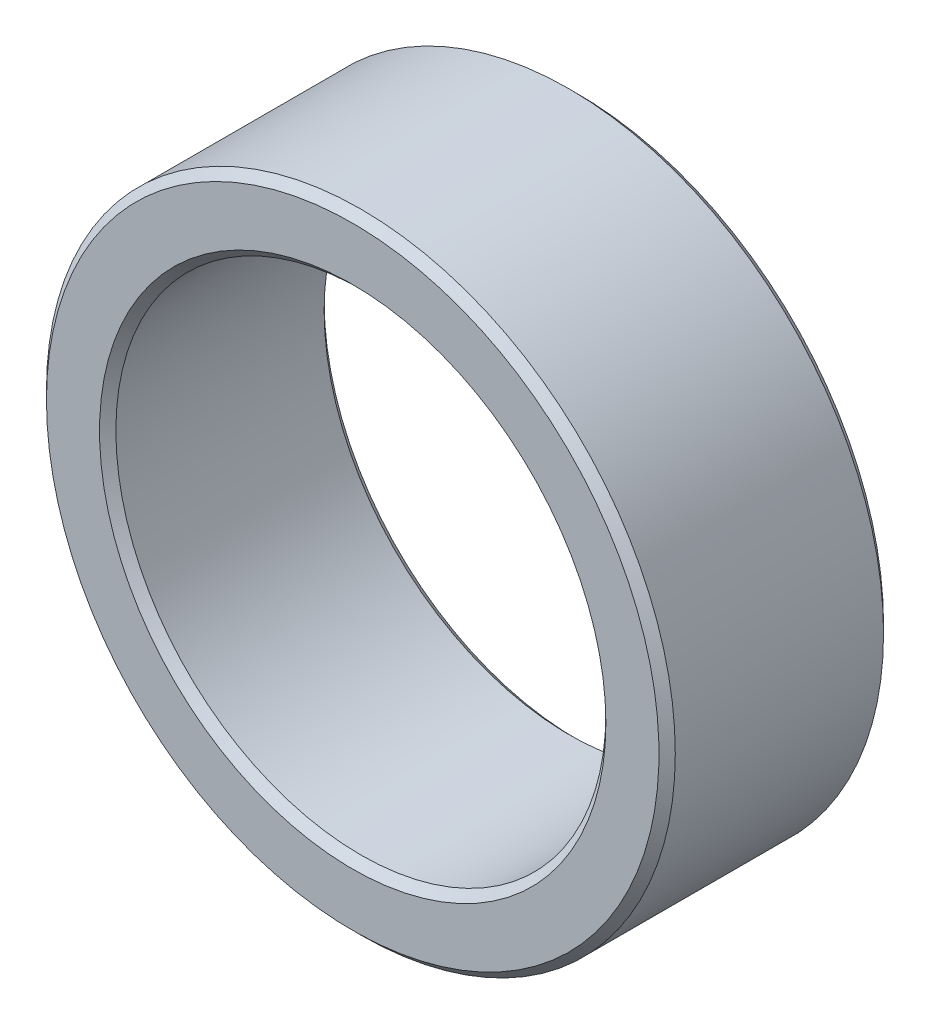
ISO-10303-21;
HEADER;
FILE_DESCRIPTION(('STEP AP214'),'2;1');
FILE_NAME('part.step','',(''),(''),'','','');
FILE_SCHEMA(('AUTOMOTIVE_DESIGN { 1 0 10303 214 1 1 1 1 }'));
ENDSEC;
DATA;
#1=APPLICATION_CONTEXT('core data for automotive mechanical design processes');
#2=APPLICATION_PROTOCOL_DEFINITION('international standard','automotive_design',2000,#1);
#3=PRODUCT_CONTEXT('',#1,'mechanical');
#4=PRODUCT('Part','Part','',(#3));
#5=PRODUCT_RELATED_PRODUCT_CATEGORY('part','',(#4));
#6=PRODUCT_DEFINITION_FORMATION('','',#4);
#7=PRODUCT_DEFINITION_CONTEXT('part definition',#1,'design');
#8=PRODUCT_DEFINITION('design','',#6,#7);
#9=PRODUCT_DEFINITION_SHAPE('','',#8);
#10=(LENGTH_UNIT() NAMED_UNIT(*) SI_UNIT(.MILLI.,.METRE.));
#11=(NAMED_UNIT(*) PLANE_ANGLE_UNIT() SI_UNIT($,.RADIAN.));
#12=(NAMED_UNIT(*) SI_UNIT($,.STERADIAN.) SOLID_ANGLE_UNIT());
#13=UNCERTAINTY_MEASURE_WITH_UNIT(LENGTH_MEASURE(1.E-05),#10,'distance_accuracy_value','');
#14=(GEOMETRIC_REPRESENTATION_CONTEXT(3) GLOBAL_UNCERTAINTY_ASSIGNED_CONTEXT((#13)) GLOBAL_UNIT_ASSIGNED_CONTEXT((#10,
#11,#12)) REPRESENTATION_CONTEXT('',''));
#15=CARTESIAN_POINT('',(0.,0.,0.));
#16=DIRECTION('',(0.,0.,1.));
#17=DIRECTION('',(1.,0.,0.));
#18=AXIS2_PLACEMENT_3D('',#15,#16,#17);
#19=CARTESIAN_POINT('',(0.,0.,-2.55));
#20=DIRECTION('',(0.,0.,-1.));
#21=DIRECTION('',(-1.,0.,0.));
#22=AXIS2_PLACEMENT_3D('',#19,#20,#21);
#23=CONICAL_SURFACE('',#22,6.,0.785398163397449);
#24=CARTESIAN_POINT('',(0.,0.,-2.55));
#25=DIRECTION('',(0.,0.,-1.));
#26=DIRECTION('',(0.,1.,0.));
#27=AXIS2_PLACEMENT_3D('',#24,#25,#26);
#28=CIRCLE('',#27,6.);
#29=CARTESIAN_POINT('',(0.,6.,-2.55));
#30=VERTEX_POINT('',#29);
#31=EDGE_CURVE('E32',#30,#30,#28,.T.);
#32=ORIENTED_EDGE('',*,*,#31,.F.);
#33=EDGE_LOOP('',(#32));
#34=FACE_BOUND('',#33,.T.);
#35=CARTESIAN_POINT('',(0.,0.,-2.75000000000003));
#36=DIRECTION('',(0.,0.,-1.));
#37=DIRECTION('',(-1.,0.,0.));
#38=AXIS2_PLACEMENT_3D('',#35,#36,#37);
#39=CIRCLE('',#38,6.20000000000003);
#40=CARTESIAN_POINT('',(-6.20000000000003,0.,-2.75000000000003));
#41=VERTEX_POINT('',#40);
#42=EDGE_CURVE('E19',#41,#41,#39,.T.);
#43=ORIENTED_EDGE('',*,*,#42,.T.);
#44=EDGE_LOOP('',(#43));
#45=FACE_BOUND('',#44,.T.);
#46=ADVANCED_FACE('F15',(#34,#45),#23,.F.);
#47=CARTESIAN_POINT('',(-7.59,-7.59,-2.75));
#48=DIRECTION('',(0.,0.,1.));
#49=DIRECTION('',(1.,0.,0.));
#50=AXIS2_PLACEMENT_3D('',#47,#48,#49);
#51=PLANE('',#50);
#52=ORIENTED_EDGE('',*,*,#42,.F.);
#53=EDGE_LOOP('',(#52));
#54=FACE_BOUND('',#53,.T.);
#55=CARTESIAN_POINT('',(0.,0.,-2.75000000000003));
#56=DIRECTION('',(0.,0.,1.));
#57=DIRECTION('',(1.,0.,0.));
#58=AXIS2_PLACEMENT_3D('',#55,#56,#57);
#59=CIRCLE('',#58,7.49999999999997);
#60=CARTESIAN_POINT('',(7.49999999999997,0.,-2.75000000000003));
#61=VERTEX_POINT('',#60);
#62=EDGE_CURVE('E36',#61,#61,#59,.F.);
#63=ORIENTED_EDGE('',*,*,#62,.T.);
#64=EDGE_LOOP('',(#63));
#65=FACE_BOUND('',#64,.T.);
#66=ADVANCED_FACE('F50',(#54,#65),#51,.F.);
#67=CARTESIAN_POINT('',(0.,0.,2.55));
#68=DIRECTION('',(0.,0.,-1.));
#69=DIRECTION('',(-1.,0.,0.));
#70=AXIS2_PLACEMENT_3D('',#67,#68,#69);
#71=CYLINDRICAL_SURFACE('',#70,6.);
#72=CARTESIAN_POINT('',(0.,0.,2.55000000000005));
#73=DIRECTION('',(0.,0.,1.));
#74=DIRECTION('',(0.,-1.,0.));
#75=AXIS2_PLACEMENT_3D('',#72,#73,#74);
#76=CIRCLE('',#75,6.);
#77=CARTESIAN_POINT('',(0.,-6.,2.55));
#78=VERTEX_POINT('',#77);
#79=EDGE_CURVE('E38',#78,#78,#76,.F.);
#80=ORIENTED_EDGE('',*,*,#79,.F.);
#81=EDGE_LOOP('',(#80));
#82=FACE_BOUND('',#81,.T.);
#83=ORIENTED_EDGE('',*,*,#31,.T.);
#84=EDGE_LOOP('',(#83));
#85=FACE_BOUND('',#84,.T.);
#86=ADVANCED_FACE('F52',(#82,#85),#71,.F.);
#87=CARTESIAN_POINT('',(0.,0.,-2.75));
#88=DIRECTION('',(0.,0.,1.));
#89=DIRECTION('',(1.,0.,0.));
#90=AXIS2_PLACEMENT_3D('',#87,#88,#89);
#91=CONICAL_SURFACE('',#90,7.5,0.785398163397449);
#92=ORIENTED_EDGE('',*,*,#62,.F.);
#93=EDGE_LOOP('',(#92));
#94=FACE_BOUND('',#93,.T.);
#95=CARTESIAN_POINT('',(0.,0.,-2.55));
#96=DIRECTION('',(0.,0.,-1.));
#97=DIRECTION('',(0.,1.,0.));
#98=AXIS2_PLACEMENT_3D('',#95,#96,#97);
#99=CIRCLE('',#98,7.7);
#100=CARTESIAN_POINT('',(0.,7.7,-2.55));
#101=VERTEX_POINT('',#100);
#102=EDGE_CURVE('E35',#101,#101,#99,.T.);
#103=ORIENTED_EDGE('',*,*,#102,.T.);
#104=EDGE_LOOP('',(#103));
#105=FACE_BOUND('',#104,.T.);
#106=ADVANCED_FACE('F58',(#94,#105),#91,.T.);
#107=CARTESIAN_POINT('',(0.,0.,2.55));
#108=DIRECTION('',(0.,0.,1.));
#109=DIRECTION('',(1.,0.,0.));
#110=AXIS2_PLACEMENT_3D('',#107,#108,#109);
#111=CONICAL_SURFACE('',#110,6.,0.785398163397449);
#112=ORIENTED_EDGE('',*,*,#79,.T.);
#113=EDGE_LOOP('',(#112));
#114=FACE_BOUND('',#113,.T.);
#115=CARTESIAN_POINT('',(0.,0.,2.75000000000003));
#116=DIRECTION('',(0.,0.,1.));
#117=DIRECTION('',(1.,0.,0.));
#118=AXIS2_PLACEMENT_3D('',#115,#116,#117);
#119=CIRCLE('',#118,6.20000000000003);
#120=CARTESIAN_POINT('',(6.20000000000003,0.,2.75000000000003));
#121=VERTEX_POINT('',#120);
#122=EDGE_CURVE('E28',#121,#121,#119,.F.);
#123=ORIENTED_EDGE('',*,*,#122,.F.);
#124=EDGE_LOOP('',(#123));
#125=FACE_BOUND('',#124,.T.);
#126=ADVANCED_FACE('F76',(#114,#125),#111,.F.);
#127=CARTESIAN_POINT('',(0.,0.,2.55));
#128=DIRECTION('',(0.,0.,-1.));
#129=DIRECTION('',(-1.,0.,0.));
#130=AXIS2_PLACEMENT_3D('',#127,#128,#129);
#131=CYLINDRICAL_SURFACE('',#130,7.7);
#132=ORIENTED_EDGE('',*,*,#102,.F.);
#133=EDGE_LOOP('',(#132));
#134=FACE_BOUND('',#133,.T.);
#135=CARTESIAN_POINT('',(0.,0.,2.55000000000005));
#136=DIRECTION('',(0.,0.,-1.));
#137=DIRECTION('',(-1.,0.,0.));
#138=AXIS2_PLACEMENT_3D('',#135,#136,#137);
#139=CIRCLE('',#138,7.7);
#140=CARTESIAN_POINT('',(-7.7,0.,2.55));
#141=VERTEX_POINT('',#140);
#142=EDGE_CURVE('E23',#141,#141,#139,.T.);
#143=ORIENTED_EDGE('',*,*,#142,.T.);
#144=EDGE_LOOP('',(#143));
#145=FACE_BOUND('',#144,.T.);
#146=ADVANCED_FACE('F70',(#134,#145),#131,.T.);
#147=CARTESIAN_POINT('',(-7.59,-7.59,2.75));
#148=DIRECTION('',(0.,0.,1.));
#149=DIRECTION('',(1.,0.,0.));
#150=AXIS2_PLACEMENT_3D('',#147,#148,#149);
#151=PLANE('',#150);
#152=ORIENTED_EDGE('',*,*,#122,.T.);
#153=EDGE_LOOP('',(#152));
#154=FACE_BOUND('',#153,.T.);
#155=CARTESIAN_POINT('',(0.,0.,2.75000000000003));
#156=DIRECTION('',(0.,0.,-1.));
#157=DIRECTION('',(-1.,0.,0.));
#158=AXIS2_PLACEMENT_3D('',#155,#156,#157);
#159=CIRCLE('',#158,7.49999999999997);
#160=CARTESIAN_POINT('',(-7.49999999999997,0.,2.75000000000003));
#161=VERTEX_POINT('',#160);
#162=EDGE_CURVE('E10',#161,#161,#159,.F.);
#163=ORIENTED_EDGE('',*,*,#162,.T.);
#164=EDGE_LOOP('',(#163));
#165=FACE_BOUND('',#164,.T.);
#166=ADVANCED_FACE('F17',(#154,#165),#151,.T.);
#167=CARTESIAN_POINT('',(0.,0.,2.75));
#168=DIRECTION('',(0.,0.,-1.));
#169=DIRECTION('',(-1.,0.,0.));
#170=AXIS2_PLACEMENT_3D('',#167,#168,#169);
#171=CONICAL_SURFACE('',#170,7.5,0.785398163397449);
#172=ORIENTED_EDGE('',*,*,#162,.F.);
#173=EDGE_LOOP('',(#172));
#174=FACE_BOUND('',#173,.T.);
#175=ORIENTED_EDGE('',*,*,#142,.F.);
#176=EDGE_LOOP('',(#175));
#177=FACE_BOUND('',#176,.T.);
#178=ADVANCED_FACE('F63',(#174,#177),#171,.T.);
#179=CLOSED_SHELL('',(#46,#66,#86,#106,#126,#146,#166,#178));
#180=MANIFOLD_SOLID_BREP('B1',#179);
#181=ADVANCED_BREP_SHAPE_REPRESENTATION('',(#18,#180),#14);
#182=SHAPE_DEFINITION_REPRESENTATION(#9,#181);
ENDSEC;
END-ISO-10303-21;
